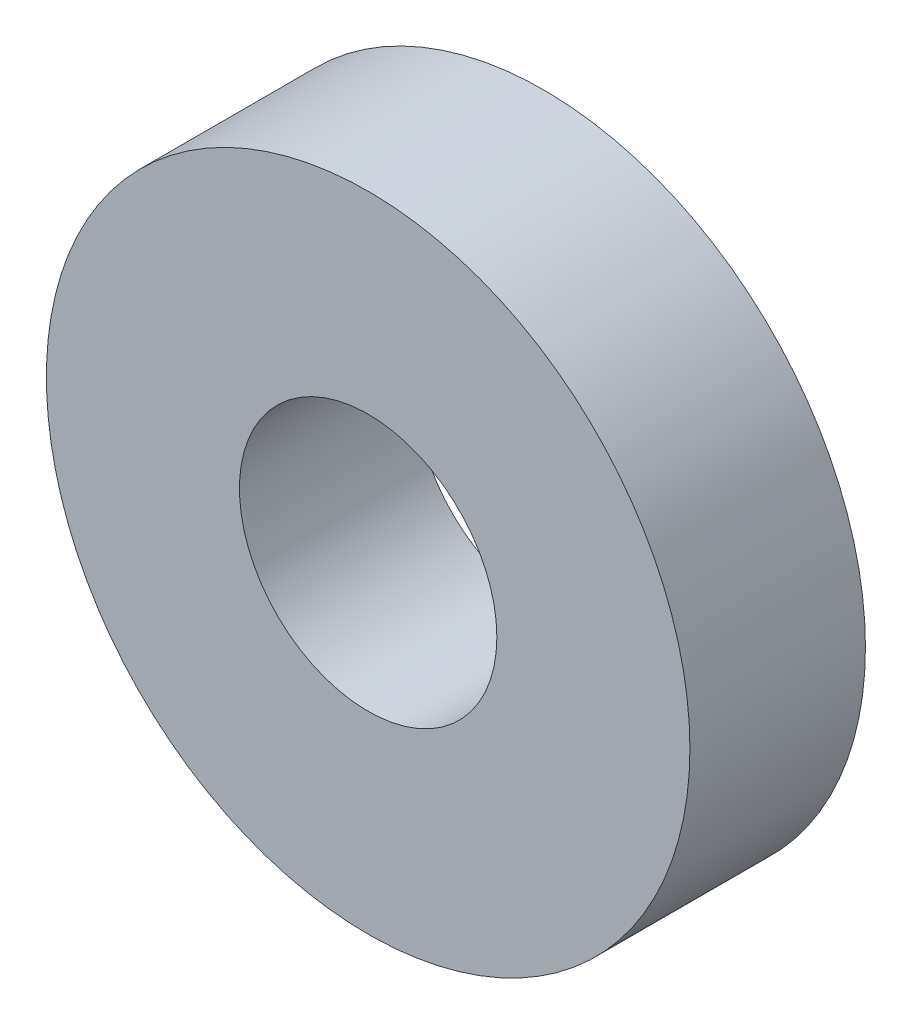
from build123d import *

# Parameters (mm, degrees)
ESQUISSE1_R      = 2.75
ESQUISSE1_R_2    = 1.1
EXTRUSION1_DEPTH = 1.5


with BuildPart() as part:
    # Esquisse1 → Extrusion1 (new body)
    with BuildSketch(Plane.XY):
        with Locations((0, -2)):
            Circle(ESQUISSE1_R)
        with Locations((0, -2)):
            Circle(ESQUISSE1_R_2, mode=Mode.SUBTRACT)
    extrude(amount=EXTRUSION1_DEPTH)


solid = part.part
